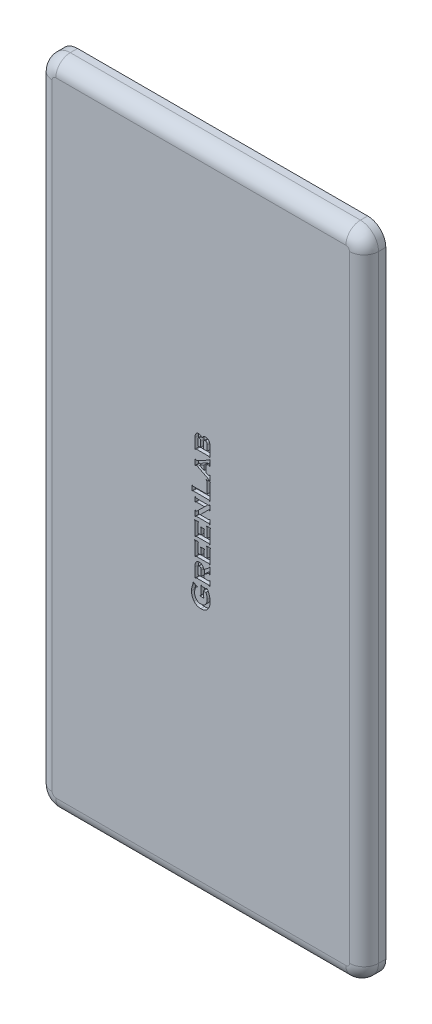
from build123d import *

# Parameters (mm, degrees)
SKETCH1_W           = 45
SKETCH1_H           = 90
BOSS_EXTRUDE1_DEPTH = 3
FILLET1_R           = 2.5
FILLET2_R           = 2
CUT_EXTRUDE1_DEPTH  = 0.5


with BuildPart() as part:
    # Sketch1 → Boss-Extrude1 (new body)
    with BuildSketch(Plane.XY.offset(3)):
        with Locations((0, 22.5)):
            Rectangle(SKETCH1_W, SKETCH1_H)
    extrude(amount=-BOSS_EXTRUDE1_DEPTH)

    # Fillet1
    fillet1_edges = [part.edges().sort_by_distance(p)[0] for p in [
        (22.5, 67.5, 1.5),
        (22.5, -22.5, 1.5),
        (-22.5, -22.5, 1.5),
        (-22.5, 67.5, 1.5),
    ]]
    fillet(fillet1_edges, radius=FILLET1_R)

    # Fillet2
    fillet2_edges = [part.edges().sort_by_distance(p)[0] for p in [
        (-22.5, 22.5, 3),
        (0, 67.5, 3),
        (0, -22.5, 3),
        (22.5, 22.5, 3),
        (21.767766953, 66.767766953, 3),
        (21.767766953, -21.767766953, 3),
        (-21.767766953, 66.767766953, 3),
        (-21.767766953, -21.767766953, 3),
    ]]
    fillet(fillet2_edges, radius=FILLET2_R)

    # Sketch2 → Cut-Extrude1 (cut)
    # profile 1 of 8: a face of its own
    with BuildSketch(Plane.XY.offset(3)):
        with BuildLine():
            add(Edge.make_bspline(
                [(0.149739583, 32.573784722), (0.160989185, 32.597643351), (0.18219199, 32.642611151), (0.216984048, 32.703527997), (0.251276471, 32.754862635), (0.276751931, 32.783442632), (0.288628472, 32.796766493)],
                knots=[0, 0, 0, 0, 1.199284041, 2.260363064, 3.188989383, 4, 4, 4, 4], degree=3))
            add(Edge.make_bspline(
                [(0.288628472, 32.796766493), (0.299797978, 32.807685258), (0.322148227, 32.829533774), (0.359592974, 32.857737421), (0.400283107, 32.880996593), (0.443106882, 32.900928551), (0.489355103, 32.915332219), (0.53813901, 32.926235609), (0.589917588, 32.932843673), (0.625342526, 32.933627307), (0.643446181, 32.934027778)],
                knots=[0, 0, 0, 0, 0.957204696, 1.915372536, 2.864513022, 3.827290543, 4.805779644, 5.828215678, 6.89012558, 8, 8, 8, 8], degree=3))
            add(Edge.make_bspline(
                [(0.643446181, 32.934027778), (0.667720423, 32.933485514), (0.71505464, 32.932428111), (0.784000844, 32.921763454), (0.848795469, 32.904776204), (0.909040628, 32.879794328), (0.965409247, 32.849147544), (1.01679032, 32.810325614), (1.064590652, 32.765336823), (1.091835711, 32.730422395), (1.105685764, 32.712673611)],
                knots=[0, 0, 0, 0, 1.09149512, 2.128390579, 3.131133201, 4.098244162, 5.056171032, 6.009871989, 6.988316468, 8, 8, 8, 8], degree=3))
            add(Edge.make_bspline(
                [(1.105685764, 32.712673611), (1.117269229, 32.695719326), (1.140818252, 32.6612515), (1.169713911, 32.604415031), (1.194739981, 32.543451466), (1.215471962, 32.477997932), (1.231171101, 32.407740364), (1.24145079, 32.332766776), (1.249057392, 32.253300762), (1.249679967, 32.19873222), (1.25, 32.170681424)],
                knots=[0, 0, 0, 0, 0.863603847, 1.755694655, 2.67743618, 3.635676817, 4.642232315, 5.703768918, 6.81962927, 8, 8, 8, 8], degree=3))
            Line((1.25, 32.170681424), (1.25, 30.746527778))
            Line((1.25, 30.746527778), (1.180555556, 30.746527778))
            add(Edge.make_bspline(
                [(1.180555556, 30.746527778), (1.177625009, 30.755432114), (1.172141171, 30.772094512), (1.162205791, 30.79512164), (1.148959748, 30.812950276), (1.13435877, 30.827490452), (1.116809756, 30.837941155), (1.096629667, 30.845530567), (1.073124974, 30.849789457), (1.056513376, 30.850379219), (1.047634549, 30.850694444)],
                knots=[0, 0, 0, 0, 1.214308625, 2.272296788, 3.227641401, 4.072125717, 4.923398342, 5.849609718, 6.850625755, 8, 8, 8, 8], degree=3))
            Line((1.047634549, 30.850694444), (-0.59624566, 30.850694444))
            add(Edge.make_bspline(
                [(-0.59624566, 30.850694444), (-0.604925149, 30.850287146), (-0.621288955, 30.84951925), (-0.644639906, 30.8463678), (-0.664166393, 30.838319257), (-0.681547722, 30.828655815), (-0.695394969, 30.813813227), (-0.708696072, 30.795899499), (-0.719741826, 30.772713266), (-0.725891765, 30.755626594), (-0.729166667, 30.746527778)],
                knots=[0, 0, 0, 0, 1.128659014, 2.127908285, 3.03439063, 3.855433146, 4.685150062, 5.642745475, 6.744739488, 8, 8, 8, 8], degree=3))
            Line((-0.729166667, 30.746527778), (-0.798611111, 30.746527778))
            Line((-0.798611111, 30.746527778), (-0.798611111, 32.144097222))
            add(Edge.make_bspline(
                [(-0.798611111, 32.144097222), (-0.798249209, 32.173771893), (-0.797550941, 32.231027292), (-0.790687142, 32.313757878), (-0.781012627, 32.390568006), (-0.765611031, 32.461009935), (-0.746966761, 32.525633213), (-0.723377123, 32.58376899), (-0.696823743, 32.636854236), (-0.674088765, 32.667739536), (-0.662977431, 32.682834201)],
                knots=[0, 0, 0, 0, 1.259629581, 2.430375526, 3.522812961, 4.543893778, 5.488959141, 6.374407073, 7.205519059, 8, 8, 8, 8], degree=3))
            add(Edge.make_bspline(
                [(-0.662977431, 32.682834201), (-0.650839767, 32.697437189), (-0.626987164, 32.726134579), (-0.585830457, 32.763196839), (-0.541494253, 32.794406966), (-0.493941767, 32.820010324), (-0.443075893, 32.840467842), (-0.388655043, 32.854098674), (-0.33107878, 32.86332541), (-0.291560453, 32.864156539), (-0.271267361, 32.864583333)],
                knots=[0, 0, 0, 0, 1.01613969, 1.996889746, 2.956405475, 3.914354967, 4.883989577, 5.884961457, 6.913904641, 8, 8, 8, 8], degree=3))
            add(Edge.make_bspline(
                [(-0.271267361, 32.864583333), (-0.247869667, 32.864027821), (-0.20287643, 32.862959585), (-0.138991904, 32.850034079), (-0.081310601, 32.830302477), (-0.029700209, 32.80047346), (0.017373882, 32.759995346), (0.064072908, 32.709803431), (0.107838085, 32.645931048), (0.135239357, 32.598751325), (0.149739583, 32.573784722)],
                knots=[0, 0, 0, 0, 1.030716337, 1.982044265, 2.862735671, 3.709827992, 4.593441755, 5.592771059, 6.726140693, 8, 8, 8, 8], degree=3))
        make_face()
        with BuildLine():
            Line((-0.034722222, 31.336805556), (-0.034722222, 32.063802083))
            add(Edge.make_bspline(
                [(-0.034722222, 32.063802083), (-0.0351577, 32.090409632), (-0.035962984, 32.139612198), (-0.043704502, 32.207131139), (-0.056632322, 32.262341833), (-0.075538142, 32.306236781), (-0.102005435, 32.339791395), (-0.136974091, 32.362780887), (-0.179491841, 32.376566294), (-0.210391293, 32.377811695), (-0.226779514, 32.378472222)],
                knots=[0, 0, 0, 0, 1.512131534, 2.796227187, 3.855933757, 4.725485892, 5.492963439, 6.248574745, 7.071092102, 8, 8, 8, 8], degree=3))
            add(Edge.make_bspline(
                [(-0.226779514, 32.378472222), (-0.24297733, 32.37778132), (-0.273276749, 32.376488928), (-0.315348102, 32.363204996), (-0.349722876, 32.340324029), (-0.376542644, 32.307289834), (-0.395385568, 32.263466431), (-0.40752412, 32.207955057), (-0.415481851, 32.140165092), (-0.416250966, 32.090594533), (-0.416666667, 32.063802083)],
                knots=[0, 0, 0, 0, 0.921305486, 1.723381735, 2.481162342, 3.2428606, 4.114909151, 5.17520465, 6.473222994, 8, 8, 8, 8], degree=3))
            Line((-0.416666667, 32.063802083), (-0.416666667, 31.336805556))
            Line((-0.416666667, 31.336805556), (-0.034722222, 31.336805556))
        make_face(mode=Mode.SUBTRACT)
        with BuildLine():
            Line((0.868055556, 31.336805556), (0.868055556, 32.085503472))
            add(Edge.make_bspline(
                [(0.868055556, 32.085503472), (0.867567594, 32.113961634), (0.866654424, 32.167218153), (0.85383534, 32.241379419), (0.834712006, 32.305026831), (0.805588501, 32.357173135), (0.768452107, 32.398832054), (0.721742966, 32.427276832), (0.667382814, 32.445659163), (0.628237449, 32.447138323), (0.607638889, 32.447916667)],
                knots=[0, 0, 0, 0, 1.344028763, 2.515211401, 3.548364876, 4.471249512, 5.318650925, 6.156286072, 7.02982502, 8, 8, 8, 8], degree=3))
            add(Edge.make_bspline(
                [(0.607638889, 32.447916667), (0.58724215, 32.447081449), (0.548145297, 32.445480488), (0.493707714, 32.427598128), (0.447369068, 32.398434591), (0.409495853, 32.357569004), (0.381462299, 32.304700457), (0.360998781, 32.241601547), (0.349584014, 32.16710476), (0.348045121, 32.113935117), (0.347222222, 32.085503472)],
                knots=[0, 0, 0, 0, 0.962178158, 1.844321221, 2.675172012, 3.52884247, 4.448055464, 5.484422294, 6.65483368, 8, 8, 8, 8], degree=3))
            Line((0.347222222, 32.085503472), (0.347222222, 31.336805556))
            Line((0.347222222, 31.336805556), (0.868055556, 31.336805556))
        make_face(mode=Mode.SUBTRACT)
    # profile 2 of 8: a face of its own
    with BuildSketch(Plane.XY.offset(3)):
        with BuildLine():
            Line((0.729166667, 29.639756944), (0.729166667, 28.689778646))
            Line((0.729166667, 28.689778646), (0.94780816, 28.576388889))
            add(Edge.make_bspline(
                [(0.94780816, 28.576388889), (0.960194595, 28.570547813), (0.983199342, 28.559699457), (1.016501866, 28.54799719), (1.045199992, 28.539237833), (1.063319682, 28.538294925), (1.071506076, 28.537868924)],
                knots=[0, 0, 0, 0, 1.258188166, 2.336773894, 3.248561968, 4, 4, 4, 4], degree=3))
            add(Edge.make_bspline(
                [(1.071506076, 28.537868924), (1.078408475, 28.538350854), (1.091712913, 28.539279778), (1.1108393, 28.544619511), (1.127715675, 28.55490056), (1.142105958, 28.569394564), (1.155732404, 28.586870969), (1.165505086, 28.609203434), (1.174324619, 28.634769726), (1.178402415, 28.653372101), (1.180555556, 28.663194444)],
                knots=[0, 0, 0, 0, 0.910861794, 1.755694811, 2.589696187, 3.483236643, 4.43677035, 5.49240796, 6.675952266, 8, 8, 8, 8], degree=3))
            Line((1.180555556, 28.663194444), (1.25, 28.663194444))
            Line((1.25, 28.663194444), (1.25, 27.934027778))
            Line((1.25, 27.934027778), (1.180555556, 27.934027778))
            add(Edge.make_bspline(
                [(1.180555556, 27.934027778), (1.178634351, 27.94493362), (1.174965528, 27.965759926), (1.165955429, 27.994265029), (1.154372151, 28.018473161), (1.139572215, 28.039329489), (1.118919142, 28.057799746), (1.092653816, 28.077587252), (1.058218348, 28.09762729), (1.03267341, 28.1111746), (1.018880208, 28.118489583)],
                knots=[0, 0, 0, 0, 1.025916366, 1.959137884, 2.761484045, 3.50604026, 4.312579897, 5.318573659, 6.552141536, 8, 8, 8, 8], degree=3))
            Line((1.018880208, 28.118489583), (-0.467122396, 28.872612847))
            add(Edge.make_bspline(
                [(-0.467122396, 28.872612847), (-0.4805931, 28.878969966), (-0.506223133, 28.891065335), (-0.544329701, 28.905131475), (-0.580194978, 28.912936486), (-0.603268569, 28.914291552), (-0.614149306, 28.914930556)],
                knots=[0, 0, 0, 0, 1.158371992, 2.203976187, 3.153055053, 4, 4, 4, 4], degree=3))
            add(Edge.make_bspline(
                [(-0.614149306, 28.914930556), (-0.625991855, 28.913638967), (-0.649999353, 28.911020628), (-0.682843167, 28.889677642), (-0.709427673, 28.855350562), (-0.722198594, 28.827205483), (-0.729166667, 28.811848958)],
                knots=[0, 0, 0, 0, 0.861054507, 1.745550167, 2.769926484, 4, 4, 4, 4], degree=3))
            Line((-0.729166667, 28.811848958), (-0.798611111, 28.811848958))
            Line((-0.798611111, 28.811848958), (-0.798611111, 29.609375))
            Line((-0.798611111, 29.609375), (-0.729166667, 29.609375))
            add(Edge.make_bspline(
                [(-0.729166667, 29.609375), (-0.722546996, 29.594246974), (-0.710247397, 29.566138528), (-0.68115365, 29.533348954), (-0.646161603, 29.512023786), (-0.620220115, 29.509659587), (-0.607096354, 29.508463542)],
                knots=[0, 0, 0, 0, 1.167592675, 2.169431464, 3.073918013, 4, 4, 4, 4], degree=3))
            add(Edge.make_bspline(
                [(-0.607096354, 29.508463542), (-0.596553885, 29.509009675), (-0.574064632, 29.51017469), (-0.539221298, 29.519868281), (-0.500938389, 29.533847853), (-0.47530642, 29.547034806), (-0.461697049, 29.554036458)],
                knots=[0, 0, 0, 0, 0.821709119, 1.75287438, 2.806881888, 4, 4, 4, 4], degree=3))
            Line((-0.461697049, 29.554036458), (0.979275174, 30.326605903))
            add(Edge.make_bspline(
                [(0.979275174, 30.326605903), (0.997231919, 30.336634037), (1.029999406, 30.354933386), (1.073701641, 30.381084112), (1.106648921, 30.404546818), (1.131475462, 30.425291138), (1.14922784, 30.447861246), (1.162533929, 30.473714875), (1.173645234, 30.50413268), (1.17815389, 30.526356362), (1.180555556, 30.538194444)],
                knots=[0, 0, 0, 0, 1.612697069, 2.942851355, 3.989484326, 4.783110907, 5.469570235, 6.224377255, 7.054163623, 8, 8, 8, 8], degree=3))
            Line((1.180555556, 30.538194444), (1.25, 30.538194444))
            Line((1.25, 30.538194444), (1.25, 29.6875))
            Line((1.25, 29.6875), (1.180555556, 29.6875))
            add(Edge.make_bspline(
                [(1.180555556, 29.6875), (1.178789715, 29.696778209), (1.17545049, 29.71432341), (1.167295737, 29.738424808), (1.157095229, 29.758902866), (1.144306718, 29.77554808), (1.129502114, 29.78914655), (1.111857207, 29.798221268), (1.092303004, 29.804003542), (1.078602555, 29.804454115), (1.071506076, 29.8046875)],
                knots=[0, 0, 0, 0, 1.280586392, 2.42160363, 3.442514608, 4.370371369, 5.257057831, 6.146457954, 7.039913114, 8, 8, 8, 8], degree=3))
            add(Edge.make_bspline(
                [(1.071506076, 29.8046875), (1.061686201, 29.804129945), (1.040622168, 29.802933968), (1.007691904, 29.793238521), (0.971554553, 29.778677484), (0.947144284, 29.76552331), (0.934244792, 29.758572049)],
                knots=[0, 0, 0, 0, 0.804870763, 1.726480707, 2.798569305, 4, 4, 4, 4], degree=3))
            Line((0.934244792, 29.758572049), (0.729166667, 29.639756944))
        make_face()
        Polygon((0.451388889, 29.494357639), (-0.203993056, 29.155815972), (0.451388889, 28.829210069), align=None, mode=Mode.SUBTRACT)
    # profile 3 of 8: a face of its own
    with BuildSketch(Plane.XY.offset(3)):
        with BuildLine():
            Line((0.833333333, 26.197916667), (0.833333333, 27.699110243))
            add(Edge.make_bspline(
                [(0.833333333, 27.699110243), (0.832916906, 27.707786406), (0.832131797, 27.724143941), (0.829116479, 27.747368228), (0.8208269, 27.766622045), (0.811291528, 27.783852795), (0.796594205, 27.797733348), (0.778459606, 27.810436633), (0.755323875, 27.820963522), (0.738263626, 27.826766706), (0.729166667, 27.829861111)],
                knots=[0, 0, 0, 0, 1.136312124, 2.142337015, 3.032986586, 3.859596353, 4.69493934, 5.645323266, 6.744426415, 8, 8, 8, 8], degree=3))
            Line((0.729166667, 27.829861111), (0.729166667, 27.899305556))
            Line((0.729166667, 27.899305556), (1.354166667, 27.899305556))
            Line((1.354166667, 27.899305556), (1.354166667, 27.829861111))
            add(Edge.make_bspline(
                [(1.354166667, 27.829861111), (1.345045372, 27.826811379), (1.328094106, 27.821143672), (1.305256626, 27.810106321), (1.28677664, 27.797928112), (1.272106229, 27.783813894), (1.262341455, 27.766753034), (1.255013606, 27.74700354), (1.250990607, 27.723862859), (1.250340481, 27.7072619), (1.25, 27.698567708)],
                knots=[0, 0, 0, 0, 1.252901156, 2.328426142, 3.296223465, 4.129788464, 4.954638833, 5.834908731, 6.866106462, 8, 8, 8, 8], degree=3))
            Line((1.25, 27.698567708), (1.25, 25.538194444))
            Line((1.25, 25.538194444), (1.180555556, 25.538194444))
            add(Edge.make_bspline(
                [(1.180555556, 25.538194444), (1.177464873, 25.547295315), (1.17166867, 25.5643629), (1.161096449, 25.587450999), (1.148459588, 25.605839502), (1.134012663, 25.620138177), (1.116676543, 25.630021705), (1.097102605, 25.638022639), (1.073586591, 25.641217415), (1.057038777, 25.641962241), (1.048177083, 25.642361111)],
                knots=[0, 0, 0, 0, 1.245850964, 2.336443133, 3.279467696, 4.125082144, 4.945291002, 5.850852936, 6.849087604, 8, 8, 8, 8], degree=3))
            Line((1.048177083, 25.642361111), (-1.048177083, 25.642361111))
            add(Edge.make_bspline(
                [(-1.048177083, 25.642361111), (-1.057041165, 25.641970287), (-1.073593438, 25.641240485), (-1.097248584, 25.637923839), (-1.117060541, 25.630125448), (-1.13453667, 25.620292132), (-1.14843106, 25.605630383), (-1.161130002, 25.587484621), (-1.171658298, 25.564352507), (-1.177461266, 25.547291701), (-1.180555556, 25.538194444)],
                knots=[0, 0, 0, 0, 1.150172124, 2.147764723, 3.074619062, 3.894300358, 4.722641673, 5.665059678, 6.754950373, 8, 8, 8, 8], degree=3))
            Line((-1.180555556, 25.538194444), (-1.25, 25.538194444))
            Line((-1.25, 25.538194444), (-1.25, 26.302083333))
            Line((-1.25, 26.302083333), (-1.180555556, 26.302083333))
            add(Edge.make_bspline(
                [(-1.180555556, 26.302083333), (-1.17767208, 26.292973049), (-1.172321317, 26.276067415), (-1.161931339, 26.253077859), (-1.149705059, 26.234505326), (-1.134993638, 26.220025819), (-1.117298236, 26.210117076), (-1.096901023, 26.203132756), (-1.073308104, 26.198831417), (-1.05651524, 26.198233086), (-1.047634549, 26.197916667)],
                knots=[0, 0, 0, 0, 1.231701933, 2.285625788, 3.242999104, 4.084239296, 4.920290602, 5.83495028, 6.855041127, 8, 8, 8, 8], degree=3))
            Line((-1.047634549, 26.197916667), (0.833333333, 26.197916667))
        make_face()
    # profile 4 of 8: a face of its own
    with BuildSketch(Plane.XY.offset(3)):
        with BuildLine():
            Line((-0.093858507, 23.28125), (1.046006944, 23.28125))
            add(Edge.make_bspline(
                [(1.046006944, 23.28125), (1.054893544, 23.281544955), (1.071519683, 23.282096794), (1.094867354, 23.286594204), (1.115310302, 23.293319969), (1.132883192, 23.304126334), (1.147818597, 23.318597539), (1.160319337, 23.337278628), (1.171849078, 23.359595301), (1.177535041, 23.376458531), (1.180555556, 23.385416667)],
                knots=[0, 0, 0, 0, 1.143670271, 2.139718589, 3.053348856, 3.900396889, 4.773630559, 5.710721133, 6.783882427, 8, 8, 8, 8], degree=3))
            Line((1.180555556, 23.385416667), (1.25, 23.385416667))
            Line((1.25, 23.385416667), (1.25, 22.725694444))
            Line((1.25, 22.725694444), (1.180555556, 22.725694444))
            add(Edge.make_bspline(
                [(1.180555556, 22.725694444), (1.177625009, 22.73459878), (1.172141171, 22.751261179), (1.162205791, 22.774288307), (1.148959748, 22.792116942), (1.13435877, 22.806657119), (1.116809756, 22.817107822), (1.096629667, 22.824697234), (1.073124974, 22.828956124), (1.056513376, 22.829545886), (1.047634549, 22.829861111)],
                knots=[0, 0, 0, 0, 1.214308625, 2.272296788, 3.227641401, 4.072125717, 4.923398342, 5.849609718, 6.850625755, 8, 8, 8, 8], degree=3))
            Line((1.047634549, 22.829861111), (-0.59624566, 22.829861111))
            add(Edge.make_bspline(
                [(-0.59624566, 22.829861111), (-0.604925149, 22.829453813), (-0.621288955, 22.828685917), (-0.644639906, 22.825534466), (-0.664166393, 22.817485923), (-0.681547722, 22.807822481), (-0.695394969, 22.792979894), (-0.708696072, 22.775066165), (-0.719741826, 22.751879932), (-0.725891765, 22.73479326), (-0.729166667, 22.725694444)],
                knots=[0, 0, 0, 0, 1.128659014, 2.127908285, 3.03439063, 3.855433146, 4.685150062, 5.642745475, 6.744739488, 8, 8, 8, 8], degree=3))
            Line((-0.729166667, 22.725694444), (-0.798611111, 22.725694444))
            Line((-0.798611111, 22.725694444), (-0.798611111, 23.496636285))
            Line((-0.798611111, 23.496636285), (-0.729166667, 23.496636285))
            add(Edge.make_bspline(
                [(-0.729166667, 23.496636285), (-0.725709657, 23.484845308), (-0.719545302, 23.463820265), (-0.7041957, 23.437700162), (-0.683665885, 23.420119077), (-0.667239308, 23.418312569), (-0.659179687, 23.417426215)],
                knots=[0, 0, 0, 0, 1.287745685, 2.296239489, 3.164058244, 4, 4, 4, 4], degree=3))
            add(Edge.make_bspline(
                [(-0.659179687, 23.417426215), (-0.651664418, 23.418315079), (-0.635251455, 23.420256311), (-0.610676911, 23.43229719), (-0.584452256, 23.450467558), (-0.567813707, 23.466344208), (-0.558810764, 23.474934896)],
                knots=[0, 0, 0, 0, 0.763994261, 1.668524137, 2.738463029, 4, 4, 4, 4], degree=3))
            Line((-0.558810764, 23.474934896), (0.511067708, 24.53125))
            Line((0.511067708, 24.53125), (-0.59624566, 24.53125))
            add(Edge.make_bspline(
                [(-0.59624566, 24.53125), (-0.604922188, 24.530826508), (-0.621458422, 24.530019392), (-0.645025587, 24.527028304), (-0.664829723, 24.518745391), (-0.682556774, 24.509216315), (-0.69705718, 24.494704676), (-0.709711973, 24.476347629), (-0.720278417, 24.453249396), (-0.726075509, 24.436183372), (-0.729166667, 24.427083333)],
                knots=[0, 0, 0, 0, 1.124712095, 2.143541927, 3.046854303, 3.885165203, 4.728679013, 5.669360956, 6.757243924, 8, 8, 8, 8], degree=3))
            Line((-0.729166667, 24.427083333), (-0.798611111, 24.427083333))
            Line((-0.798611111, 24.427083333), (-0.798611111, 25.086805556))
            Line((-0.798611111, 25.086805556), (-0.729166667, 25.086805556))
            add(Edge.make_bspline(
                [(-0.729166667, 25.086805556), (-0.726120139, 25.077681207), (-0.720458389, 25.060724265), (-0.70938246, 25.037923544), (-0.697255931, 25.019218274), (-0.682517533, 25.004738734), (-0.664959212, 24.994970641), (-0.644828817, 24.987743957), (-0.621546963, 24.983611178), (-0.604941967, 24.982973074), (-0.59624566, 24.982638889)],
                knots=[0, 0, 0, 0, 1.243685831, 2.311300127, 3.271979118, 4.116123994, 4.955062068, 5.850833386, 6.874446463, 8, 8, 8, 8], degree=3))
            Line((-0.59624566, 24.982638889), (1.046006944, 24.982638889))
            add(Edge.make_bspline(
                [(1.046006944, 24.982638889), (1.054705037, 24.982969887), (1.071313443, 24.983601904), (1.094572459, 24.987775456), (1.114628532, 24.994819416), (1.131819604, 25.004913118), (1.146499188, 25.019320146), (1.1590811, 25.038006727), (1.171467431, 25.060518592), (1.177388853, 25.07764602), (1.180555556, 25.086805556)],
                knots=[0, 0, 0, 0, 1.122381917, 2.143110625, 3.036357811, 3.852834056, 4.694600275, 5.665840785, 6.751720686, 8, 8, 8, 8], degree=3))
            Line((1.180555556, 25.086805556), (1.25, 25.086805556))
            Line((1.25, 25.086805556), (1.25, 24.368489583))
            Line((1.25, 24.368489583), (1.180555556, 24.368489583))
            add(Edge.make_bspline(
                [(1.180555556, 24.368489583), (1.177588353, 24.380040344), (1.172238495, 24.400866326), (1.158685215, 24.427214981), (1.138616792, 24.444467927), (1.1227832, 24.446263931), (1.114908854, 24.447157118)],
                knots=[0, 0, 0, 0, 1.28387963, 2.314830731, 3.161933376, 4, 4, 4, 4], degree=3))
            add(Edge.make_bspline(
                [(1.114908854, 24.447157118), (1.106201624, 24.445940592), (1.087083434, 24.443269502), (1.064902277, 24.427811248), (1.044096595, 24.409162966), (1.02095723, 24.388298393), (0.991411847, 24.360348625), (0.969999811, 24.339067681), (0.958116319, 24.327256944)],
                knots=[0, 0, 0, 0, 0.778870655, 1.71014178, 2.353616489, 3.294570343, 4.498510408, 6, 6, 6, 6], degree=3))
            Line((0.958116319, 24.327256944), (-0.093858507, 23.28125))
        make_face()
    # profile 5 of 8: a face of its own
    with BuildSketch(Plane.XY.offset(3)):
        with BuildLine():
            Line((0.416666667, 20.920138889), (0.868055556, 20.920138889))
            Line((0.868055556, 20.920138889), (0.868055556, 22.17827691))
            add(Edge.make_bspline(
                [(0.868055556, 22.17827691), (0.867667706, 22.186962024), (0.866944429, 22.203158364), (0.863600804, 22.226262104), (0.855884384, 22.245612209), (0.845640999, 22.262547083), (0.831559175, 22.276946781), (0.813137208, 22.289563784), (0.79005989, 22.300142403), (0.772990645, 22.30593762), (0.763888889, 22.309027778)],
                knots=[0, 0, 0, 0, 1.136968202, 2.120262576, 3.033418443, 3.84032541, 4.69303108, 5.643963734, 6.743701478, 8, 8, 8, 8], degree=3))
            Line((0.763888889, 22.309027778), (0.763888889, 22.378472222))
            Line((0.763888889, 22.378472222), (1.354166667, 22.378472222))
            Line((1.354166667, 22.378472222), (1.354166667, 22.309027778))
            add(Edge.make_bspline(
                [(1.354166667, 22.309027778), (1.345210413, 22.306394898), (1.328327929, 22.301431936), (1.305886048, 22.290485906), (1.287544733, 22.277886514), (1.272894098, 22.263577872), (1.261944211, 22.246384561), (1.255367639, 22.226041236), (1.250874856, 22.20288586), (1.250302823, 22.186440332), (1.25, 22.177734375)],
                knots=[0, 0, 0, 0, 1.21379651, 2.287998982, 3.235193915, 4.101035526, 4.937230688, 5.860712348, 6.867500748, 8, 8, 8, 8], degree=3))
            Line((1.25, 22.177734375), (1.25, 20.329861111))
            Line((1.25, 20.329861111), (1.180555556, 20.329861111))
            add(Edge.make_bspline(
                [(1.180555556, 20.329861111), (1.177625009, 20.338765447), (1.172141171, 20.355427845), (1.162205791, 20.378454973), (1.148959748, 20.396283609), (1.13435877, 20.410823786), (1.116809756, 20.421274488), (1.096629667, 20.4288639), (1.073124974, 20.43312279), (1.056513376, 20.433712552), (1.047634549, 20.434027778)],
                knots=[0, 0, 0, 0, 1.214308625, 2.272296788, 3.227641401, 4.072125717, 4.923398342, 5.849609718, 6.850625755, 8, 8, 8, 8], degree=3))
            Line((1.047634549, 20.434027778), (-0.59624566, 20.434027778))
            add(Edge.make_bspline(
                [(-0.59624566, 20.434027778), (-0.604925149, 20.43362048), (-0.621288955, 20.432852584), (-0.644639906, 20.429701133), (-0.664166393, 20.42165259), (-0.681547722, 20.411989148), (-0.695394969, 20.39714656), (-0.708696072, 20.379232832), (-0.719741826, 20.356046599), (-0.725891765, 20.338959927), (-0.729166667, 20.329861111)],
                knots=[0, 0, 0, 0, 1.128659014, 2.127908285, 3.03439063, 3.855433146, 4.685150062, 5.642745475, 6.744739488, 8, 8, 8, 8], degree=3))
            Line((-0.729166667, 20.329861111), (-0.798611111, 20.329861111))
            Line((-0.798611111, 20.329861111), (-0.798611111, 22.107747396))
            add(Edge.make_bspline(
                [(-0.798611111, 22.107747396), (-0.799009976, 22.116609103), (-0.799754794, 22.133156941), (-0.802949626, 22.156672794), (-0.810950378, 22.176247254), (-0.820834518, 22.193581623), (-0.835130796, 22.208035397), (-0.853529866, 22.220642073), (-0.876514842, 22.231328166), (-0.893661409, 22.236717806), (-0.902777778, 22.239583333)],
                knots=[0, 0, 0, 0, 1.152027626, 2.151229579, 3.057668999, 3.878672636, 4.725106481, 5.669044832, 6.76069378, 8, 8, 8, 8], degree=3))
            Line((-0.902777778, 22.239583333), (-0.902777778, 22.309027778))
            Line((-0.902777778, 22.309027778), (-0.3125, 22.309027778))
            Line((-0.3125, 22.309027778), (-0.3125, 22.239583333))
            add(Edge.make_bspline(
                [(-0.3125, 22.239583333), (-0.321624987, 22.236730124), (-0.338787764, 22.231363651), (-0.361802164, 22.220462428), (-0.380642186, 22.208219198), (-0.3949461, 22.193552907), (-0.404859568, 22.176496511), (-0.412334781, 22.156773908), (-0.415477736, 22.13352135), (-0.416257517, 22.116972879), (-0.416666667, 22.108289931)],
                knots=[0, 0, 0, 0, 1.241043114, 2.334222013, 3.298856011, 4.146476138, 4.968630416, 5.84602308, 6.869812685, 8, 8, 8, 8], degree=3))
            Line((-0.416666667, 22.108289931), (-0.416666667, 20.920138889))
            Line((-0.416666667, 20.920138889), (0.034722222, 20.920138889))
            Line((0.034722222, 20.920138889), (0.034722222, 21.657443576))
            add(Edge.make_bspline(
                [(0.034722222, 21.657443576), (0.034317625, 21.665944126), (0.033555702, 21.681952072), (0.030378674, 21.704751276), (0.022413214, 21.72382052), (0.012318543, 21.740628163), (-0.001765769, 21.755051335), (-0.02031762, 21.767580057), (-0.043212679, 21.778828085), (-0.060329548, 21.784939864), (-0.069444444, 21.788194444)],
                knots=[0, 0, 0, 0, 1.117146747, 2.103772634, 2.997955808, 3.807596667, 4.6631914, 5.617345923, 6.731213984, 8, 8, 8, 8], degree=3))
            Line((-0.069444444, 21.788194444), (-0.069444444, 21.857638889))
            Line((-0.069444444, 21.857638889), (0.520833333, 21.857638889))
            Line((0.520833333, 21.857638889), (0.520833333, 21.788194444))
            add(Edge.make_bspline(
                [(0.520833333, 21.788194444), (0.511883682, 21.785348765), (0.495062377, 21.780000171), (0.472486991, 21.768955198), (0.453937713, 21.756836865), (0.439395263, 21.742530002), (0.428894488, 21.725809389), (0.421727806, 21.70584988), (0.417643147, 21.682747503), (0.417002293, 21.666140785), (0.416666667, 21.657443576)],
                knots=[0, 0, 0, 0, 1.225527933, 2.303439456, 3.273384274, 4.108798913, 4.947881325, 5.830104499, 6.863590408, 8, 8, 8, 8], degree=3))
            Line((0.416666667, 21.657443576), (0.416666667, 20.920138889))
        make_face()
    # profile 6 of 8: a face of its own
    with BuildSketch(Plane.XY.offset(3)):
        with BuildLine():
            Line((0.416666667, 18.524305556), (0.868055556, 18.524305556))
            Line((0.868055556, 18.524305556), (0.868055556, 19.782443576))
            add(Edge.make_bspline(
                [(0.868055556, 19.782443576), (0.867667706, 19.791128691), (0.866944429, 19.807325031), (0.863600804, 19.830428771), (0.855884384, 19.849778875), (0.845640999, 19.866713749), (0.831559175, 19.881113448), (0.813137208, 19.893730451), (0.79005989, 19.90430907), (0.772990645, 19.910104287), (0.763888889, 19.913194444)],
                knots=[0, 0, 0, 0, 1.136968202, 2.120262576, 3.033418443, 3.84032541, 4.69303108, 5.643963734, 6.743701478, 8, 8, 8, 8], degree=3))
            Line((0.763888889, 19.913194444), (0.763888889, 19.982638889))
            Line((0.763888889, 19.982638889), (1.354166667, 19.982638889))
            Line((1.354166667, 19.982638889), (1.354166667, 19.913194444))
            add(Edge.make_bspline(
                [(1.354166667, 19.913194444), (1.345210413, 19.910561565), (1.328327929, 19.905598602), (1.305886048, 19.894652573), (1.287544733, 19.88205318), (1.272894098, 19.867744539), (1.261944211, 19.850551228), (1.255367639, 19.830207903), (1.250874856, 19.807052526), (1.250302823, 19.790606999), (1.25, 19.781901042)],
                knots=[0, 0, 0, 0, 1.21379651, 2.287998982, 3.235193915, 4.101035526, 4.937230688, 5.860712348, 6.867500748, 8, 8, 8, 8], degree=3))
            Line((1.25, 19.781901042), (1.25, 17.934027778))
            Line((1.25, 17.934027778), (1.180555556, 17.934027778))
            add(Edge.make_bspline(
                [(1.180555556, 17.934027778), (1.177625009, 17.942932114), (1.172141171, 17.959594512), (1.162205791, 17.98262164), (1.148959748, 18.000450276), (1.13435877, 18.014990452), (1.116809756, 18.025441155), (1.096629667, 18.033030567), (1.073124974, 18.037289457), (1.056513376, 18.037879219), (1.047634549, 18.038194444)],
                knots=[0, 0, 0, 0, 1.214308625, 2.272296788, 3.227641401, 4.072125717, 4.923398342, 5.849609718, 6.850625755, 8, 8, 8, 8], degree=3))
            Line((1.047634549, 18.038194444), (-0.59624566, 18.038194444))
            add(Edge.make_bspline(
                [(-0.59624566, 18.038194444), (-0.604925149, 18.037787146), (-0.621288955, 18.03701925), (-0.644639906, 18.0338678), (-0.664166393, 18.025819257), (-0.681547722, 18.016155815), (-0.695394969, 18.001313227), (-0.708696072, 17.983399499), (-0.719741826, 17.960213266), (-0.725891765, 17.943126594), (-0.729166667, 17.934027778)],
                knots=[0, 0, 0, 0, 1.128659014, 2.127908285, 3.03439063, 3.855433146, 4.685150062, 5.642745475, 6.744739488, 8, 8, 8, 8], degree=3))
            Line((-0.729166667, 17.934027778), (-0.798611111, 17.934027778))
            Line((-0.798611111, 17.934027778), (-0.798611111, 19.711914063))
            add(Edge.make_bspline(
                [(-0.798611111, 19.711914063), (-0.799009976, 19.72077577), (-0.799754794, 19.737323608), (-0.802949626, 19.760839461), (-0.810950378, 19.780413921), (-0.820834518, 19.79774829), (-0.835130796, 19.812202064), (-0.853529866, 19.82480874), (-0.876514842, 19.835494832), (-0.893661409, 19.840884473), (-0.902777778, 19.84375)],
                knots=[0, 0, 0, 0, 1.152027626, 2.151229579, 3.057668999, 3.878672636, 4.725106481, 5.669044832, 6.76069378, 8, 8, 8, 8], degree=3))
            Line((-0.902777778, 19.84375), (-0.902777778, 19.913194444))
            Line((-0.902777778, 19.913194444), (-0.3125, 19.913194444))
            Line((-0.3125, 19.913194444), (-0.3125, 19.84375))
            add(Edge.make_bspline(
                [(-0.3125, 19.84375), (-0.321624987, 19.84089679), (-0.338787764, 19.835530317), (-0.361802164, 19.824629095), (-0.380642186, 19.812385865), (-0.3949461, 19.797719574), (-0.404859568, 19.780663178), (-0.412334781, 19.760940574), (-0.415477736, 19.737688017), (-0.416257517, 19.721139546), (-0.416666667, 19.712456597)],
                knots=[0, 0, 0, 0, 1.241043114, 2.334222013, 3.298856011, 4.146476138, 4.968630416, 5.84602308, 6.869812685, 8, 8, 8, 8], degree=3))
            Line((-0.416666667, 19.712456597), (-0.416666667, 18.524305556))
            Line((-0.416666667, 18.524305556), (0.034722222, 18.524305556))
            Line((0.034722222, 18.524305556), (0.034722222, 19.261610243))
            add(Edge.make_bspline(
                [(0.034722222, 19.261610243), (0.034317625, 19.270110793), (0.033555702, 19.286118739), (0.030378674, 19.308917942), (0.022413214, 19.327987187), (0.012318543, 19.344794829), (-0.001765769, 19.359218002), (-0.02031762, 19.371746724), (-0.043212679, 19.382994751), (-0.060329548, 19.38910653), (-0.069444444, 19.392361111)],
                knots=[0, 0, 0, 0, 1.117146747, 2.103772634, 2.997955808, 3.807596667, 4.6631914, 5.617345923, 6.731213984, 8, 8, 8, 8], degree=3))
            Line((-0.069444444, 19.392361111), (-0.069444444, 19.461805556))
            Line((-0.069444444, 19.461805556), (0.520833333, 19.461805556))
            Line((0.520833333, 19.461805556), (0.520833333, 19.392361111))
            add(Edge.make_bspline(
                [(0.520833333, 19.392361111), (0.511883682, 19.389515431), (0.495062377, 19.384166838), (0.472486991, 19.373121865), (0.453937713, 19.361003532), (0.439395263, 19.346696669), (0.428894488, 19.329976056), (0.421727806, 19.310016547), (0.417643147, 19.286914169), (0.417002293, 19.270307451), (0.416666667, 19.261610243)],
                knots=[0, 0, 0, 0, 1.225527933, 2.303439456, 3.273384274, 4.108798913, 4.947881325, 5.830104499, 6.863590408, 8, 8, 8, 8], degree=3))
            Line((0.416666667, 19.261610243), (0.416666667, 18.524305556))
        make_face()
    # profile 7 of 8: a face of its own
    with BuildSketch(Plane.XY.offset(3)):
        with BuildLine():
            Line((0.416666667, 15.954861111), (1.048177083, 15.954861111))
            add(Edge.make_bspline(
                [(1.048177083, 15.954861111), (1.056883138, 15.955155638), (1.073151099, 15.955705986), (1.095966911, 15.960194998), (1.115631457, 15.966873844), (1.13243131, 15.977324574), (1.147027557, 15.991531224), (1.159708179, 16.010095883), (1.171327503, 16.032906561), (1.177330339, 16.049898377), (1.180555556, 16.059027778)],
                knots=[0, 0, 0, 0, 1.133233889, 2.117538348, 3.019422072, 3.823678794, 4.673583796, 5.654214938, 6.739651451, 8, 8, 8, 8], degree=3))
            Line((1.180555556, 16.059027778), (1.25, 16.059027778))
            Line((1.25, 16.059027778), (1.25, 15.364583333))
            Line((1.25, 15.364583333), (1.180555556, 15.364583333))
            add(Edge.make_bspline(
                [(1.180555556, 15.364583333), (1.177625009, 15.373487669), (1.172141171, 15.390150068), (1.162205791, 15.413177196), (1.148959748, 15.431005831), (1.13435877, 15.445546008), (1.116809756, 15.45599671), (1.096629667, 15.463586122), (1.073124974, 15.467845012), (1.056513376, 15.468434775), (1.047634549, 15.46875)],
                knots=[0, 0, 0, 0, 1.214308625, 2.272296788, 3.227641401, 4.072125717, 4.923398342, 5.849609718, 6.850625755, 8, 8, 8, 8], degree=3))
            Line((1.047634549, 15.46875), (-0.59624566, 15.46875))
            add(Edge.make_bspline(
                [(-0.59624566, 15.46875), (-0.604925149, 15.468342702), (-0.621288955, 15.467574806), (-0.644639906, 15.464423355), (-0.664166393, 15.456374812), (-0.681547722, 15.44671137), (-0.695394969, 15.431868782), (-0.708696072, 15.413955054), (-0.719741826, 15.390768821), (-0.725891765, 15.373682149), (-0.729166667, 15.364583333)],
                knots=[0, 0, 0, 0, 1.128659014, 2.127908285, 3.03439063, 3.855433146, 4.685150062, 5.642745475, 6.744739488, 8, 8, 8, 8], degree=3))
            Line((-0.729166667, 15.364583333), (-0.798611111, 15.364583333))
            Line((-0.798611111, 15.364583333), (-0.798611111, 16.694878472))
            add(Edge.make_bspline(
                [(-0.798611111, 16.694878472), (-0.798345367, 16.735574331), (-0.797847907, 16.811755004), (-0.793076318, 16.918355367), (-0.785381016, 17.00947457), (-0.774083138, 17.087322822), (-0.758125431, 17.155904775), (-0.736250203, 17.218597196), (-0.709814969, 17.278083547), (-0.687608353, 17.314666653), (-0.676540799, 17.332899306)],
                knots=[0, 0, 0, 0, 1.481606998, 2.773496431, 3.884065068, 4.809673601, 5.635344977, 6.4432619, 7.224137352, 8, 8, 8, 8], degree=3))
            add(Edge.make_bspline(
                [(-0.676540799, 17.332899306), (-0.66400279, 17.35047408), (-0.639267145, 17.385146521), (-0.594040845, 17.429915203), (-0.54346232, 17.467843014), (-0.487110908, 17.499052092), (-0.424700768, 17.522674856), (-0.357050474, 17.540065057), (-0.283708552, 17.550504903), (-0.232963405, 17.551545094), (-0.206705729, 17.552083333)],
                knots=[0, 0, 0, 0, 0.954938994, 1.883953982, 2.805234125, 3.748304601, 4.727237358, 5.753162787, 6.837391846, 8, 8, 8, 8], degree=3))
            add(Edge.make_bspline(
                [(-0.206705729, 17.552083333), (-0.186614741, 17.551684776), (-0.147407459, 17.550906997), (-0.090219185, 17.544326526), (-0.036559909, 17.533431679), (0.014020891, 17.51909248), (0.060657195, 17.499164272), (0.104677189, 17.476016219), (0.144664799, 17.447609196), (0.181705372, 17.415166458), (0.215345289, 17.377765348), (0.247287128, 17.335796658), (0.27549296, 17.287981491), (0.301929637, 17.235286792), (0.325390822, 17.177276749), (0.347290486, 17.11417691), (0.366137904, 17.045600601), (0.376563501, 16.997846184), (0.381944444, 16.973198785)],
                knots=[0, 0, 0, 0, 1.054974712, 2.05876829, 3.018077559, 3.928757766, 4.81427522, 5.67693176, 6.535972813, 7.383915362, 8.257948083, 9.17356801, 10.149288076, 11.168732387, 12.267602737, 13.433048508, 14.67512408, 16, 16, 16, 16], degree=3))
            Line((0.381944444, 16.973198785), (0.917426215, 17.370334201))
            add(Edge.make_bspline(
                [(0.917426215, 17.370334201), (0.939840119, 17.387301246), (0.981292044, 17.418679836), (1.036055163, 17.464972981), (1.080188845, 17.504858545), (1.11374773, 17.541153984), (1.138893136, 17.576359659), (1.15798626, 17.612483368), (1.172472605, 17.650753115), (1.177846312, 17.677491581), (1.180555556, 17.690972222)],
                knots=[0, 0, 0, 0, 1.582811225, 2.927226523, 4.03709032, 4.931114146, 5.705394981, 6.46623019, 7.226724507, 8, 8, 8, 8], degree=3))
            Line((1.180555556, 17.690972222), (1.25, 17.690972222))
            Line((1.25, 17.690972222), (1.25, 16.765950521))
            Line((1.25, 16.765950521), (1.180555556, 16.765950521))
            add(Edge.make_bspline(
                [(1.180555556, 16.765950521), (1.17646946, 16.78068241), (1.169184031, 16.80694908), (1.151361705, 16.839110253), (1.128881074, 16.861716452), (1.11022475, 16.864099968), (1.101345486, 16.865234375)],
                knots=[0, 0, 0, 0, 1.338390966, 2.386324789, 3.231989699, 4, 4, 4, 4], degree=3))
            add(Edge.make_bspline(
                [(1.101345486, 16.865234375), (1.093818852, 16.864357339), (1.076572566, 16.862347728), (1.049723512, 16.848240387), (1.017187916, 16.829288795), (0.995156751, 16.811859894), (0.983072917, 16.802300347)],
                knots=[0, 0, 0, 0, 0.664756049, 1.523200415, 2.641504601, 4, 4, 4, 4], degree=3))
            Line((0.983072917, 16.802300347), (0.416666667, 16.393771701))
            Line((0.416666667, 16.393771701), (0.416666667, 15.954861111))
        make_face()
        with BuildLine():
            Line((0.034722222, 15.954861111), (0.034722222, 16.700303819))
            add(Edge.make_bspline(
                [(0.034722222, 16.700303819), (0.034369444, 16.726727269), (0.03371095, 16.776049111), (0.027382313, 16.844627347), (0.01708042, 16.902652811), (0.004585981, 16.936248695), (-0.001085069, 16.951497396)],
                knots=[0, 0, 0, 0, 1.241709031, 2.317766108, 3.236457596, 4, 4, 4, 4], degree=3))
            add(Edge.make_bspline(
                [(-0.001085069, 16.951497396), (-0.005348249, 16.960505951), (-0.013674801, 16.978100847), (-0.0302998, 17.001554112), (-0.049120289, 17.022186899), (-0.072151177, 17.038028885), (-0.097807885, 17.050465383), (-0.126241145, 17.059762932), (-0.157664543, 17.065270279), (-0.179555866, 17.065731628), (-0.190972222, 17.065972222)],
                knots=[0, 0, 0, 0, 1.008030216, 1.968815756, 2.902121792, 3.822384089, 4.781245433, 5.783764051, 6.844229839, 8, 8, 8, 8], degree=3))
            add(Edge.make_bspline(
                [(-0.190972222, 17.065972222), (-0.210619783, 17.06524444), (-0.247355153, 17.063883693), (-0.297846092, 17.048533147), (-0.338924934, 17.022822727), (-0.364865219, 16.992412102), (-0.379242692, 16.96276566), (-0.390081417, 16.937094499), (-0.397557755, 16.907000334), (-0.404881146, 16.873235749), (-0.410059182, 16.835500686), (-0.413659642, 16.793850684), (-0.416701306, 16.748451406), (-0.416678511, 16.716766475), (-0.416666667, 16.700303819)],
                knots=[0, 0, 0, 0, 1.425165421, 2.66465546, 3.788225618, 4.907941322, 5.513716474, 6.180377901, 6.930065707, 7.763120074, 8.692993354, 9.696653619, 10.803241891, 12, 12, 12, 12], degree=3))
            Line((-0.416666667, 16.700303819), (-0.416666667, 15.954861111))
            Line((-0.416666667, 15.954861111), (0.034722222, 15.954861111))
        make_face(mode=Mode.SUBTRACT)
    # profile 8 of 8: a face of its own
    with BuildSketch(Plane.XY.offset(3)):
        with BuildLine():
            Line((0.347222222, 14.392361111), (0.347222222, 13.763020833))
            add(Edge.make_bspline(
                [(0.347222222, 13.763020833), (0.347542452, 13.753960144), (0.34814859, 13.736809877), (0.352383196, 13.71284588), (0.359300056, 13.692385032), (0.369355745, 13.675078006), (0.383976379, 13.660915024), (0.402618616, 13.648864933), (0.425151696, 13.63704123), (0.442236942, 13.631461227), (0.451388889, 13.628472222)],
                knots=[0, 0, 0, 0, 1.162769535, 2.20091524, 3.111292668, 3.923438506, 4.744164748, 5.697055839, 6.76639631, 8, 8, 8, 8], degree=3))
            Line((0.451388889, 13.628472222), (0.451388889, 13.559027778))
            Line((0.451388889, 13.559027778), (-0.104166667, 13.559027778))
            Line((-0.104166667, 13.559027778), (-0.104166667, 13.628472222))
            add(Edge.make_bspline(
                [(-0.104166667, 13.628472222), (-0.094825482, 13.631449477), (-0.077373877, 13.637011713), (-0.054659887, 13.648880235), (-0.035489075, 13.660132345), (-0.021801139, 13.674690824), (-0.011508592, 13.691220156), (-0.004478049, 13.711166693), (-0.001123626, 13.734697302), (-0.000389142, 13.751438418), (0, 13.76030816)],
                knots=[0, 0, 0, 0, 1.267855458, 2.368662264, 3.318017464, 4.130433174, 4.930580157, 5.827855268, 6.849158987, 8, 8, 8, 8], degree=3))
            Line((0, 13.76030816), (0, 14.947916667))
            Line((0, 14.947916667), (0.069444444, 14.947916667))
            add(Edge.make_bspline(
                [(0.069444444, 14.947916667), (0.072259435, 14.938947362), (0.077550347, 14.922089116), (0.088885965, 14.89993235), (0.099622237, 14.880885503), (0.113438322, 14.866732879), (0.129272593, 14.855655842), (0.148459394, 14.849205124), (0.170315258, 14.844557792), (0.185877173, 14.844032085), (0.194227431, 14.84375)],
                knots=[0, 0, 0, 0, 1.260451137, 2.369079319, 3.340265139, 4.182477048, 5.004819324, 5.912182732, 6.879712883, 8, 8, 8, 8], degree=3))
            Line((0.194227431, 14.84375), (0.673828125, 14.84375))
            add(Edge.make_bspline(
                [(0.673828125, 14.84375), (0.682157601, 14.844119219), (0.697646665, 14.844805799), (0.719556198, 14.848345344), (0.738157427, 14.855412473), (0.754280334, 14.865530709), (0.767790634, 14.880008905), (0.779437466, 14.898753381), (0.79042069, 14.921614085), (0.795768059, 14.938786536), (0.798611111, 14.947916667)],
                knots=[0, 0, 0, 0, 1.117892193, 2.078774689, 2.961505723, 3.768722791, 4.60913424, 5.591204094, 6.719307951, 8, 8, 8, 8], degree=3))
            Line((0.798611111, 14.947916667), (0.868055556, 14.947916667))
            add(Edge.make_bspline(
                [(0.868055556, 14.947916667), (0.901306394, 14.889333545), (0.966665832, 14.774179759), (1.051148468, 14.597911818), (1.123083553, 14.4231664), (1.181933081, 14.249782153), (1.22792273, 14.077820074), (1.26040836, 13.907208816), (1.280912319, 13.737842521), (1.283457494, 13.625273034), (1.284722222, 13.569335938)],
                knots=[0, 0, 0, 0, 1.109239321, 2.180373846, 3.216973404, 4.220153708, 5.194106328, 6.146335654, 7.078892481, 8, 8, 8, 8], degree=3))
            add(Edge.make_bspline(
                [(1.284722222, 13.569335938), (1.283986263, 13.519930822), (1.282549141, 13.423456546), (1.268488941, 13.282269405), (1.246541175, 13.148074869), (1.215806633, 13.020599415), (1.175551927, 12.900044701), (1.126165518, 12.78660225), (1.068183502, 12.67974051), (1.022226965, 12.614071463), (0.999348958, 12.581380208)],
                knots=[0, 0, 0, 0, 1.132985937, 2.212402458, 3.251065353, 4.250163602, 5.21697858, 6.162602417, 7.085309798, 8, 8, 8, 8], degree=3))
            add(Edge.make_bspline(
                [(0.999348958, 12.581380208), (0.984168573, 12.561875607), (0.954033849, 12.523156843), (0.905928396, 12.468372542), (0.855026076, 12.417838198), (0.802718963, 12.370449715), (0.747401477, 12.32740661), (0.690094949, 12.288026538), (0.630940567, 12.251828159), (0.569179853, 12.220575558), (0.505624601, 12.19202152), (0.439559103, 12.167821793), (0.371389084, 12.147270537), (0.301271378, 12.129525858), (0.228693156, 12.116815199), (0.153891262, 12.107739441), (0.077151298, 12.101320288), (0.025150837, 12.100904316), (-0.001085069, 12.100694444)],
                knots=[0, 0, 0, 0, 1.027594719, 2.039887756, 3.02889878, 4.008719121, 4.97294883, 5.940778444, 6.898978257, 7.854104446, 8.816896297, 9.794723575, 10.777166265, 11.776613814, 12.800294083, 13.838400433, 14.909403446, 16, 16, 16, 16], degree=3))
            add(Edge.make_bspline(
                [(-0.001085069, 12.100694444), (-0.049624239, 12.101836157), (-0.144426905, 12.104066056), (-0.2828534, 12.124688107), (-0.41361329, 12.158277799), (-0.537141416, 12.204809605), (-0.652470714, 12.265875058), (-0.760529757, 12.339325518), (-0.860943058, 12.426804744), (-0.919974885, 12.494039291), (-0.949978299, 12.528211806)],
                knots=[0, 0, 0, 0, 1.080618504, 2.110574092, 3.109061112, 4.08310081, 5.043468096, 6.008781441, 6.987946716, 8, 8, 8, 8], degree=3))
            add(Edge.make_bspline(
                [(-0.949978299, 12.528211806), (-0.977010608, 12.562730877), (-1.031319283, 12.632080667), (-1.098570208, 12.747213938), (-1.156516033, 12.869864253), (-1.203687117, 13.001041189), (-1.239848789, 13.140572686), (-1.265688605, 13.288247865), (-1.281667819, 13.444201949), (-1.28368846, 13.551031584), (-1.284722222, 13.605685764)],
                knots=[0, 0, 0, 0, 0.913103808, 1.834451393, 2.772129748, 3.738097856, 4.735733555, 5.773315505, 6.860825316, 8, 8, 8, 8], degree=3))
            add(Edge.make_bspline(
                [(-1.284722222, 13.605685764), (-1.284112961, 13.640778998), (-1.282912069, 13.709950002), (-1.276048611, 13.812133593), (-1.263397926, 13.911161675), (-1.245834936, 14.008994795), (-1.221898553, 14.108495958), (-1.191809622, 14.213103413), (-1.154967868, 14.324018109), (-1.126398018, 14.399514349), (-1.111653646, 14.438476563)],
                knots=[0, 0, 0, 0, 0.983904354, 1.939338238, 2.869415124, 3.781350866, 4.72455948, 5.737149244, 6.832184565, 8, 8, 8, 8], degree=3))
            add(Edge.make_bspline(
                [(-1.111653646, 14.438476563), (-1.104222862, 14.457578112), (-1.090590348, 14.492621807), (-1.074748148, 14.541236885), (-1.064487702, 14.581117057), (-1.062571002, 14.604995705), (-1.061740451, 14.615342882)],
                knots=[0, 0, 0, 0, 1.33242011, 2.444457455, 3.325947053, 4, 4, 4, 4], degree=3))
            add(Edge.make_bspline(
                [(-1.061740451, 14.615342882), (-1.062380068, 14.622083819), (-1.063745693, 14.636476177), (-1.071786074, 14.658597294), (-1.086113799, 14.681409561), (-1.097771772, 14.696645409), (-1.10405816, 14.704861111)],
                knots=[0, 0, 0, 0, 0.803820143, 1.716210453, 2.768500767, 4, 4, 4, 4], degree=3))
            Line((-1.10405816, 14.704861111), (-1.076388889, 14.774305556))
            Line((-1.076388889, 14.774305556), (-0.477430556, 14.479166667))
            Line((-0.477430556, 14.479166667), (-0.505642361, 14.425998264))
            add(Edge.make_bspline(
                [(-0.505642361, 14.425998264), (-0.515250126, 14.425696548), (-0.53292155, 14.425141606), (-0.557160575, 14.420973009), (-0.577292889, 14.416515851), (-0.594498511, 14.409832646), (-0.609467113, 14.398649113), (-0.625852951, 14.384749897), (-0.64292875, 14.365336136), (-0.654545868, 14.350816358), (-0.660807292, 14.342990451)],
                knots=[0, 0, 0, 0, 1.244331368, 2.288680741, 3.181265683, 3.916936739, 4.658188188, 5.588746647, 6.700376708, 8, 8, 8, 8], degree=3))
            add(Edge.make_bspline(
                [(-0.660807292, 14.342990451), (-0.675063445, 14.322320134), (-0.705318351, 14.278452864), (-0.742718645, 14.201490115), (-0.777608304, 14.112172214), (-0.808540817, 14.012355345), (-0.834726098, 13.907883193), (-0.853751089, 13.803509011), (-0.865742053, 13.701995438), (-0.867294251, 13.635194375), (-0.868055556, 13.602430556)],
                knots=[0, 0, 0, 0, 0.772496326, 1.63941874, 2.627276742, 3.724866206, 4.855665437, 5.9428017, 6.991008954, 8, 8, 8, 8], degree=3))
            add(Edge.make_bspline(
                [(-0.868055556, 13.602430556), (-0.867506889, 13.570210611), (-0.866434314, 13.507224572), (-0.855766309, 13.414688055), (-0.838592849, 13.326500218), (-0.814661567, 13.242201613), (-0.783836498, 13.162425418), (-0.7458094, 13.086855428), (-0.701918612, 13.014859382), (-0.666554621, 12.971099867), (-0.648871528, 12.94921875)],
                knots=[0, 0, 0, 0, 1.098368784, 2.14717621, 3.171603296, 4.15934231, 5.131674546, 6.083189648, 7.041535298, 8, 8, 8, 8], degree=3))
            add(Edge.make_bspline(
                [(-0.648871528, 12.94921875), (-0.62788857, 12.925714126), (-0.58663618, 12.879504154), (-0.516055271, 12.820080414), (-0.441157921, 12.769439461), (-0.361166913, 12.727678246), (-0.276060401, 12.695598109), (-0.185921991, 12.67312424), (-0.09109294, 12.658299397), (-0.026099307, 12.656942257), (0.007052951, 12.65625)],
                knots=[0, 0, 0, 0, 1.016795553, 1.999014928, 2.971244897, 3.932867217, 4.907271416, 5.901990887, 6.92983762, 8, 8, 8, 8], degree=3))
            add(Edge.make_bspline(
                [(0.007052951, 12.65625), (0.03929706, 12.656989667), (0.102456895, 12.65843853), (0.194595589, 12.672563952), (0.282077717, 12.69445556), (0.364560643, 12.726392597), (0.442553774, 12.766585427), (0.515756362, 12.815854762), (0.584301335, 12.874084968), (0.62460502, 12.919235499), (0.645073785, 12.942165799)],
                knots=[0, 0, 0, 0, 1.069572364, 2.095080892, 3.086556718, 4.05754135, 5.024062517, 5.993022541, 6.980729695, 8, 8, 8, 8], degree=3))
            add(Edge.make_bspline(
                [(0.645073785, 12.942165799), (0.66289434, 12.964434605), (0.698692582, 13.009168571), (0.744305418, 13.082803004), (0.782097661, 13.161999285), (0.813760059, 13.245783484), (0.838245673, 13.33478101), (0.855186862, 13.429033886), (0.866595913, 13.528366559), (0.867562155, 13.596429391), (0.868055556, 13.631184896)],
                knots=[0, 0, 0, 0, 0.924808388, 1.857771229, 2.80254234, 3.768129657, 4.760342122, 5.792672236, 6.872853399, 8, 8, 8, 8], degree=3))
            add(Edge.make_bspline(
                [(0.868055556, 13.631184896), (0.867639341, 13.665750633), (0.866807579, 13.734826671), (0.856789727, 13.838004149), (0.842731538, 13.940665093), (0.821227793, 14.041406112), (0.795796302, 14.138610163), (0.765552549, 14.230096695), (0.730507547, 14.314451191), (0.702961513, 14.366864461), (0.689561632, 14.392361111)],
                knots=[0, 0, 0, 0, 1.050243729, 2.098803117, 3.148241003, 4.198254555, 5.227561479, 6.200971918, 7.124855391, 8, 8, 8, 8], degree=3))
            Line((0.689561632, 14.392361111), (0.347222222, 14.392361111))
        make_face()
    extrude(amount=-CUT_EXTRUDE1_DEPTH, mode=Mode.SUBTRACT)


solid = part.part
